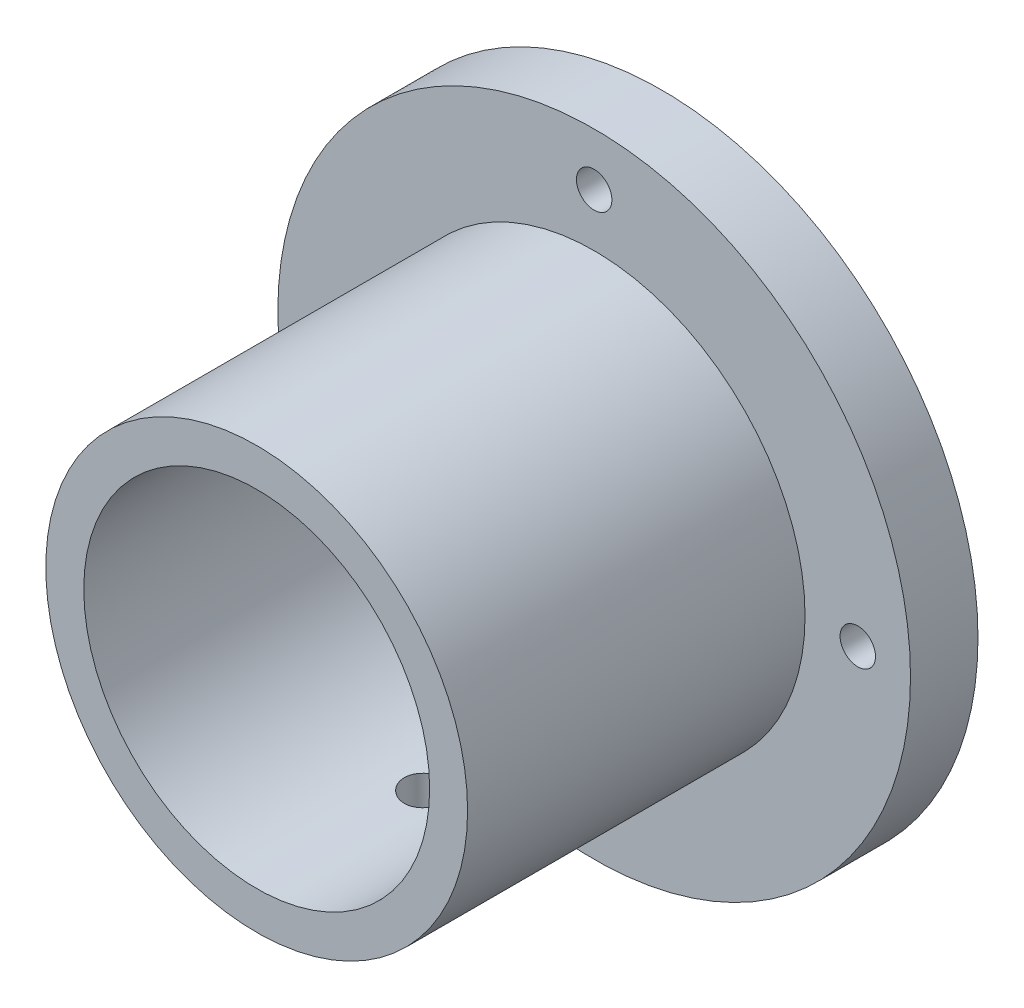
ISO-10303-21;
HEADER;
FILE_DESCRIPTION(('STEP AP214'),'2;1');
FILE_NAME('part.step','',(''),(''),'','','');
FILE_SCHEMA(('AUTOMOTIVE_DESIGN { 1 0 10303 214 1 1 1 1 }'));
ENDSEC;
DATA;
#1=APPLICATION_CONTEXT('core data for automotive mechanical design processes');
#2=APPLICATION_PROTOCOL_DEFINITION('international standard','automotive_design',2000,#1);
#3=PRODUCT_CONTEXT('',#1,'mechanical');
#4=PRODUCT('Part','Part','',(#3));
#5=PRODUCT_RELATED_PRODUCT_CATEGORY('part','',(#4));
#6=PRODUCT_DEFINITION_FORMATION('','',#4);
#7=PRODUCT_DEFINITION_CONTEXT('part definition',#1,'design');
#8=PRODUCT_DEFINITION('design','',#6,#7);
#9=PRODUCT_DEFINITION_SHAPE('','',#8);
#10=(LENGTH_UNIT() NAMED_UNIT(*) SI_UNIT(.MILLI.,.METRE.));
#11=(NAMED_UNIT(*) PLANE_ANGLE_UNIT() SI_UNIT($,.RADIAN.));
#12=(NAMED_UNIT(*) SI_UNIT($,.STERADIAN.) SOLID_ANGLE_UNIT());
#13=UNCERTAINTY_MEASURE_WITH_UNIT(LENGTH_MEASURE(1.E-05),#10,'distance_accuracy_value','');
#14=(GEOMETRIC_REPRESENTATION_CONTEXT(3) GLOBAL_UNCERTAINTY_ASSIGNED_CONTEXT((#13)) GLOBAL_UNIT_ASSIGNED_CONTEXT((#10,
#11,#12)) REPRESENTATION_CONTEXT('',''));
#15=CARTESIAN_POINT('',(0.,0.,0.));
#16=DIRECTION('',(0.,0.,1.));
#17=DIRECTION('',(1.,0.,0.));
#18=AXIS2_PLACEMENT_3D('',#15,#16,#17);
#19=CARTESIAN_POINT('',(-3.63797880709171E-12,3.63797880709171E-12,8.));
#20=DIRECTION('',(0.,0.,1.));
#21=DIRECTION('',(1.,0.,0.));
#22=AXIS2_PLACEMENT_3D('',#19,#20,#21);
#23=PLANE('',#22);
#24=CARTESIAN_POINT('',(31.2499999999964,3.63797880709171E-12,8.));
#25=DIRECTION('',(0.,0.,1.));
#26=DIRECTION('',(1.,0.,0.));
#27=AXIS2_PLACEMENT_3D('',#24,#25,#26);
#28=CIRCLE('',#27,2.1);
#29=CARTESIAN_POINT('',(33.3499999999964,3.63797880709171E-12,8.));
#30=VERTEX_POINT('',#29);
#31=EDGE_CURVE('E64',#30,#30,#28,.T.);
#32=ORIENTED_EDGE('',*,*,#31,.F.);
#33=EDGE_LOOP('',(#32));
#34=FACE_BOUND('',#33,.T.);
#35=CARTESIAN_POINT('',(-31.2500000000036,3.63797880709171E-12,8.));
#36=DIRECTION('',(0.,0.,1.));
#37=DIRECTION('',(1.,0.,0.));
#38=AXIS2_PLACEMENT_3D('',#35,#36,#37);
#39=CIRCLE('',#38,2.1);
#40=CARTESIAN_POINT('',(-29.1500000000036,3.63797880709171E-12,8.));
#41=VERTEX_POINT('',#40);
#42=EDGE_CURVE('E52',#41,#41,#39,.T.);
#43=ORIENTED_EDGE('',*,*,#42,.F.);
#44=EDGE_LOOP('',(#43));
#45=FACE_BOUND('',#44,.T.);
#46=CARTESIAN_POINT('',(-3.63797880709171E-12,3.63797880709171E-12,8.));
#47=DIRECTION('',(0.,0.,1.));
#48=DIRECTION('',(1.,0.,0.));
#49=AXIS2_PLACEMENT_3D('',#46,#47,#48);
#50=CIRCLE('',#49,37.5);
#51=CARTESIAN_POINT('',(37.4999999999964,3.63797880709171E-12,8.));
#52=VERTEX_POINT('',#51);
#53=EDGE_CURVE('E10',#52,#52,#50,.T.);
#54=ORIENTED_EDGE('',*,*,#53,.T.);
#55=EDGE_LOOP('',(#54));
#56=FACE_BOUND('',#55,.T.);
#57=CARTESIAN_POINT('',(-3.63797880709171E-12,31.2500000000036,8.));
#58=DIRECTION('',(0.,0.,1.));
#59=DIRECTION('',(1.,0.,0.));
#60=AXIS2_PLACEMENT_3D('',#57,#58,#59);
#61=CIRCLE('',#60,2.1);
#62=CARTESIAN_POINT('',(2.09999999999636,31.2500000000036,8.));
#63=VERTEX_POINT('',#62);
#64=EDGE_CURVE('E47',#63,#63,#61,.T.);
#65=ORIENTED_EDGE('',*,*,#64,.F.);
#66=EDGE_LOOP('',(#65));
#67=FACE_BOUND('',#66,.T.);
#68=CARTESIAN_POINT('',(-3.63797880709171E-12,-31.2499999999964,8.));
#69=DIRECTION('',(0.,0.,1.));
#70=DIRECTION('',(1.,0.,0.));
#71=AXIS2_PLACEMENT_3D('',#68,#69,#70);
#72=CIRCLE('',#71,2.1);
#73=CARTESIAN_POINT('',(2.09999999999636,-31.2499999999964,8.));
#74=VERTEX_POINT('',#73);
#75=EDGE_CURVE('E58',#74,#74,#72,.T.);
#76=ORIENTED_EDGE('',*,*,#75,.F.);
#77=EDGE_LOOP('',(#76));
#78=FACE_BOUND('',#77,.T.);
#79=CARTESIAN_POINT('',(0.,0.,8.));
#80=DIRECTION('',(0.,0.,1.));
#81=DIRECTION('',(1.,0.,0.));
#82=AXIS2_PLACEMENT_3D('',#79,#80,#81);
#83=CIRCLE('',#82,25.);
#84=CARTESIAN_POINT('',(25.,0.,8.));
#85=VERTEX_POINT('',#84);
#86=EDGE_CURVE('E73',#85,#85,#83,.T.);
#87=ORIENTED_EDGE('',*,*,#86,.F.);
#88=EDGE_LOOP('',(#87));
#89=FACE_BOUND('',#88,.T.);
#90=ADVANCED_FACE('F30',(#34,#45,#56,#67,#78,#89),#23,.T.);
#91=CARTESIAN_POINT('',(-3.63797880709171E-12,3.63797880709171E-12,0.));
#92=DIRECTION('',(0.,0.,1.));
#93=DIRECTION('',(1.,0.,0.));
#94=AXIS2_PLACEMENT_3D('',#91,#92,#93);
#95=PLANE('',#94);
#96=CARTESIAN_POINT('',(0.,0.,0.));
#97=DIRECTION('',(0.,0.,1.));
#98=DIRECTION('',(1.,0.,0.));
#99=AXIS2_PLACEMENT_3D('',#96,#97,#98);
#100=CIRCLE('',#99,20.5);
#101=CARTESIAN_POINT('',(20.5,0.,0.));
#102=VERTEX_POINT('',#101);
#103=EDGE_CURVE('E76',#102,#102,#100,.T.);
#104=ORIENTED_EDGE('',*,*,#103,.T.);
#105=EDGE_LOOP('',(#104));
#106=FACE_BOUND('',#105,.T.);
#107=CARTESIAN_POINT('',(-3.63797880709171E-12,-31.2499999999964,0.));
#108=DIRECTION('',(0.,0.,1.));
#109=DIRECTION('',(1.,0.,0.));
#110=AXIS2_PLACEMENT_3D('',#107,#108,#109);
#111=CIRCLE('',#110,2.1);
#112=CARTESIAN_POINT('',(2.09999999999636,-31.2499999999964,0.));
#113=VERTEX_POINT('',#112);
#114=EDGE_CURVE('E61',#113,#113,#111,.T.);
#115=ORIENTED_EDGE('',*,*,#114,.T.);
#116=EDGE_LOOP('',(#115));
#117=FACE_BOUND('',#116,.T.);
#118=CARTESIAN_POINT('',(-3.63797880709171E-12,31.2500000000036,0.));
#119=DIRECTION('',(0.,0.,1.));
#120=DIRECTION('',(1.,0.,0.));
#121=AXIS2_PLACEMENT_3D('',#118,#119,#120);
#122=CIRCLE('',#121,2.1);
#123=CARTESIAN_POINT('',(2.09999999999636,31.2500000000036,0.));
#124=VERTEX_POINT('',#123);
#125=EDGE_CURVE('E49',#124,#124,#122,.T.);
#126=ORIENTED_EDGE('',*,*,#125,.T.);
#127=EDGE_LOOP('',(#126));
#128=FACE_BOUND('',#127,.T.);
#129=CARTESIAN_POINT('',(-3.63797880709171E-12,3.63797880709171E-12,0.));
#130=DIRECTION('',(0.,0.,1.));
#131=DIRECTION('',(1.,0.,0.));
#132=AXIS2_PLACEMENT_3D('',#129,#130,#131);
#133=CIRCLE('',#132,37.5);
#134=CARTESIAN_POINT('',(37.4999999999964,3.63797880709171E-12,0.));
#135=VERTEX_POINT('',#134);
#136=EDGE_CURVE('E42',#135,#135,#133,.T.);
#137=ORIENTED_EDGE('',*,*,#136,.F.);
#138=EDGE_LOOP('',(#137));
#139=FACE_BOUND('',#138,.T.);
#140=CARTESIAN_POINT('',(-31.2500000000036,3.63797880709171E-12,0.));
#141=DIRECTION('',(0.,0.,1.));
#142=DIRECTION('',(1.,0.,0.));
#143=AXIS2_PLACEMENT_3D('',#140,#141,#142);
#144=CIRCLE('',#143,2.1);
#145=CARTESIAN_POINT('',(-29.1500000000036,3.63797880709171E-12,0.));
#146=VERTEX_POINT('',#145);
#147=EDGE_CURVE('E55',#146,#146,#144,.T.);
#148=ORIENTED_EDGE('',*,*,#147,.T.);
#149=EDGE_LOOP('',(#148));
#150=FACE_BOUND('',#149,.T.);
#151=CARTESIAN_POINT('',(31.2499999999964,3.63797880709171E-12,0.));
#152=DIRECTION('',(0.,0.,1.));
#153=DIRECTION('',(1.,0.,0.));
#154=AXIS2_PLACEMENT_3D('',#151,#152,#153);
#155=CIRCLE('',#154,2.1);
#156=CARTESIAN_POINT('',(33.3499999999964,3.63797880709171E-12,0.));
#157=VERTEX_POINT('',#156);
#158=EDGE_CURVE('E67',#157,#157,#155,.T.);
#159=ORIENTED_EDGE('',*,*,#158,.T.);
#160=EDGE_LOOP('',(#159));
#161=FACE_BOUND('',#160,.T.);
#162=ADVANCED_FACE('F113',(#106,#117,#128,#139,#150,#161),#95,.F.);
#163=CARTESIAN_POINT('',(-3.63797880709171E-12,3.63797880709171E-12,8.));
#164=DIRECTION('',(0.,0.,-1.));
#165=DIRECTION('',(-1.,0.,0.));
#166=AXIS2_PLACEMENT_3D('',#163,#164,#165);
#167=CYLINDRICAL_SURFACE('',#166,37.5);
#168=ORIENTED_EDGE('',*,*,#53,.F.);
#169=EDGE_LOOP('',(#168));
#170=FACE_BOUND('',#169,.T.);
#171=ORIENTED_EDGE('',*,*,#136,.T.);
#172=EDGE_LOOP('',(#171));
#173=FACE_BOUND('',#172,.T.);
#174=ADVANCED_FACE('F32',(#170,#173),#167,.T.);
#175=CARTESIAN_POINT('',(-3.63797880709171E-12,31.2500000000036,8.));
#176=DIRECTION('',(0.,0.,-1.));
#177=DIRECTION('',(-1.,0.,0.));
#178=AXIS2_PLACEMENT_3D('',#175,#176,#177);
#179=CYLINDRICAL_SURFACE('',#178,2.1);
#180=ORIENTED_EDGE('',*,*,#64,.T.);
#181=EDGE_LOOP('',(#180));
#182=FACE_BOUND('',#181,.T.);
#183=ORIENTED_EDGE('',*,*,#125,.F.);
#184=EDGE_LOOP('',(#183));
#185=FACE_BOUND('',#184,.T.);
#186=ADVANCED_FACE('F123',(#182,#185),#179,.F.);
#187=CARTESIAN_POINT('',(-31.2500000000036,3.63797880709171E-12,8.));
#188=DIRECTION('',(0.,0.,-1.));
#189=DIRECTION('',(-1.,0.,0.));
#190=AXIS2_PLACEMENT_3D('',#187,#188,#189);
#191=CYLINDRICAL_SURFACE('',#190,2.1);
#192=ORIENTED_EDGE('',*,*,#42,.T.);
#193=EDGE_LOOP('',(#192));
#194=FACE_BOUND('',#193,.T.);
#195=ORIENTED_EDGE('',*,*,#147,.F.);
#196=EDGE_LOOP('',(#195));
#197=FACE_BOUND('',#196,.T.);
#198=ADVANCED_FACE('F126',(#194,#197),#191,.F.);
#199=CARTESIAN_POINT('',(-3.63797880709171E-12,-31.2499999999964,8.));
#200=DIRECTION('',(0.,0.,-1.));
#201=DIRECTION('',(-1.,0.,0.));
#202=AXIS2_PLACEMENT_3D('',#199,#200,#201);
#203=CYLINDRICAL_SURFACE('',#202,2.1);
#204=ORIENTED_EDGE('',*,*,#75,.T.);
#205=EDGE_LOOP('',(#204));
#206=FACE_BOUND('',#205,.T.);
#207=ORIENTED_EDGE('',*,*,#114,.F.);
#208=EDGE_LOOP('',(#207));
#209=FACE_BOUND('',#208,.T.);
#210=ADVANCED_FACE('F130',(#206,#209),#203,.F.);
#211=CARTESIAN_POINT('',(31.2499999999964,3.63797880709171E-12,8.));
#212=DIRECTION('',(0.,0.,-1.));
#213=DIRECTION('',(-1.,0.,0.));
#214=AXIS2_PLACEMENT_3D('',#211,#212,#213);
#215=CYLINDRICAL_SURFACE('',#214,2.1);
#216=ORIENTED_EDGE('',*,*,#31,.T.);
#217=EDGE_LOOP('',(#216));
#218=FACE_BOUND('',#217,.T.);
#219=ORIENTED_EDGE('',*,*,#158,.F.);
#220=EDGE_LOOP('',(#219));
#221=FACE_BOUND('',#220,.T.);
#222=ADVANCED_FACE('F108',(#218,#221),#215,.F.);
#223=CARTESIAN_POINT('',(0.,0.,48.));
#224=DIRECTION('',(0.,0.,-1.));
#225=DIRECTION('',(-1.,0.,0.));
#226=AXIS2_PLACEMENT_3D('',#223,#224,#225);
#227=CYLINDRICAL_SURFACE('',#226,25.);
#228=CARTESIAN_POINT('',(0.,-25.,30.5));
#229=CARTESIAN_POINT('',(0.140050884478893,-24.9999983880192,30.4999939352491));
#230=CARTESIAN_POINT('',(0.280194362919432,-24.9988106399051,30.4881918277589));
#231=CARTESIAN_POINT('',(0.556595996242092,-24.9941866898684,30.4412890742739));
#232=CARTESIAN_POINT('',(0.69284969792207,-24.9907480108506,30.4061627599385));
#233=CARTESIAN_POINT('',(0.957429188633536,-24.9820103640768,30.3136443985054));
#234=CARTESIAN_POINT('',(1.08575971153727,-24.9767125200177,30.2562657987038));
#235=CARTESIAN_POINT('',(1.33094040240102,-24.9648489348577,30.1208977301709));
#236=CARTESIAN_POINT('',(1.44779284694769,-24.9582834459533,30.0429123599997));
#237=CARTESIAN_POINT('',(1.6671488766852,-24.9445936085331,29.8682432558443));
#238=CARTESIAN_POINT('',(1.76960536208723,-24.9374675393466,29.7715005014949));
#239=CARTESIAN_POINT('',(1.95685630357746,-24.9234739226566,29.5621886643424));
#240=CARTESIAN_POINT('',(2.04164994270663,-24.9166063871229,29.449618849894));
#241=CARTESIAN_POINT('',(2.19133492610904,-24.9038897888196,29.2115536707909));
#242=CARTESIAN_POINT('',(2.2561836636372,-24.8980429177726,29.0860313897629));
#243=CARTESIAN_POINT('',(2.3638659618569,-24.8880509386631,28.8258110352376));
#244=CARTESIAN_POINT('',(2.40670006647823,-24.8839057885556,28.6911131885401));
#245=CARTESIAN_POINT('',(2.46899760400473,-24.8778021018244,28.416845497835));
#246=CARTESIAN_POINT('',(2.48853913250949,-24.8758362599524,28.2772935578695));
#247=CARTESIAN_POINT('',(2.5039382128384,-24.8742910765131,27.9968778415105));
#248=CARTESIAN_POINT('',(2.499796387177,-24.8747116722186,27.8560140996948));
#249=CARTESIAN_POINT('',(2.4680107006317,-24.8778851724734,27.5775117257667));
#250=CARTESIAN_POINT('',(2.44045211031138,-24.8806296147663,27.4398632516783));
#251=CARTESIAN_POINT('',(2.36274786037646,-24.8881283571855,27.1711550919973));
#252=CARTESIAN_POINT('',(2.31260189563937,-24.8928826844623,27.0400954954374));
#253=CARTESIAN_POINT('',(2.19105223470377,-24.9038752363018,26.7880160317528));
#254=CARTESIAN_POINT('',(2.11961070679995,-24.9101160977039,26.6670145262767));
#255=CARTESIAN_POINT('',(1.95752506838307,-24.923376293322,26.4386869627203));
#256=CARTESIAN_POINT('',(1.86688039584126,-24.9303956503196,26.3313613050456));
#257=CARTESIAN_POINT('',(1.66848528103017,-24.9444596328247,26.1329365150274));
#258=CARTESIAN_POINT('',(1.56066119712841,-24.9515042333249,26.041910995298));
#259=CARTESIAN_POINT('',(1.33122370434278,-24.964795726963,25.879240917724));
#260=CARTESIAN_POINT('',(1.209610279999,-24.9710426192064,25.8075963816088));
#261=CARTESIAN_POINT('',(0.955995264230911,-24.9820368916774,25.6857249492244));
#262=CARTESIAN_POINT('',(0.823991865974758,-24.9867840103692,25.6355017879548));
#263=CARTESIAN_POINT('',(0.553368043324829,-24.9942411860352,25.5579527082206));
#264=CARTESIAN_POINT('',(0.4147478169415,-24.9969513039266,25.5306261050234));
#265=CARTESIAN_POINT('',(0.135462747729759,-25.0000212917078,25.4997392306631));
#266=CARTESIAN_POINT('',(-0.00519075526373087,-25.0003912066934,25.4960773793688));
#267=CARTESIAN_POINT('',(-0.28510948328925,-24.9987660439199,25.5123571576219));
#268=CARTESIAN_POINT('',(-0.424374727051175,-24.9967709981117,25.5322984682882));
#269=CARTESIAN_POINT('',(-0.697270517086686,-24.9906465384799,25.5951342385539));
#270=CARTESIAN_POINT('',(-0.830912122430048,-24.986521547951,25.637981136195));
#271=CARTESIAN_POINT('',(-1.08911080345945,-24.9765999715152,25.7453629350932));
#272=CARTESIAN_POINT('',(-1.21366767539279,-24.9708033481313,25.8098983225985));
#273=CARTESIAN_POINT('',(-1.45062045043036,-24.9581618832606,25.9590770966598));
#274=CARTESIAN_POINT('',(-1.56297414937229,-24.951313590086,26.0437872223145));
#275=CARTESIAN_POINT('',(-1.7719040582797,-24.937348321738,26.2308151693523));
#276=CARTESIAN_POINT('',(-1.86847987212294,-24.9302313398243,26.3331334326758));
#277=CARTESIAN_POINT('',(-2.04346527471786,-24.9165006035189,26.5529164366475));
#278=CARTESIAN_POINT('',(-2.12180819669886,-24.9098887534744,26.6704343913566));
#279=CARTESIAN_POINT('',(-2.25764564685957,-24.8979458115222,26.9170184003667));
#280=CARTESIAN_POINT('',(-2.3151404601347,-24.8926147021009,27.046084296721));
#281=CARTESIAN_POINT('',(-2.40753802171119,-24.8838486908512,27.3118718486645));
#282=CARTESIAN_POINT('',(-2.44248043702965,-24.8804104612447,27.4485796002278));
#283=CARTESIAN_POINT('',(-2.48891001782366,-24.8758091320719,27.7259579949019));
#284=CARTESIAN_POINT('',(-2.50039785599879,-24.8746459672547,27.8666285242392));
#285=CARTESIAN_POINT('',(-2.49958284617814,-24.8747278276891,28.1472767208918));
#286=CARTESIAN_POINT('',(-2.48738472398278,-24.8759622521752,28.287254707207));
#287=CARTESIAN_POINT('',(-2.43976363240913,-24.8806775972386,28.5631622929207));
#288=CARTESIAN_POINT('',(-2.4043406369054,-24.884158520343,28.699091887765));
#289=CARTESIAN_POINT('',(-2.31130421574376,-24.8929717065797,28.9630433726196));
#290=CARTESIAN_POINT('',(-2.25369386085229,-24.898303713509,29.0910663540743));
#291=CARTESIAN_POINT('',(-2.11792888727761,-24.910218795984,29.3356422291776));
#292=CARTESIAN_POINT('',(-2.03977438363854,-24.9168018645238,29.4521951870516));
#293=CARTESIAN_POINT('',(-1.86474639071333,-24.9305121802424,29.6710591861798));
#294=CARTESIAN_POINT('',(-1.76779487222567,-24.9376416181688,29.7733076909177));
#295=CARTESIAN_POINT('',(-1.55807924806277,-24.9516213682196,29.9601305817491));
#296=CARTESIAN_POINT('',(-1.44531136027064,-24.9584716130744,30.0447007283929));
#297=CARTESIAN_POINT('',(-1.20685358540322,-24.971139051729,30.1939336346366));
#298=CARTESIAN_POINT('',(-1.08113187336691,-24.9769536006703,30.258545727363));
#299=CARTESIAN_POINT('',(-0.820645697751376,-24.9868657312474,30.3656560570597));
#300=CARTESIAN_POINT('',(-0.685891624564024,-24.9909652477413,30.4081792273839));
#301=CARTESIAN_POINT('',(-0.458645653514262,-24.9959553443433,30.459301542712));
#302=CARTESIAN_POINT('',(-0.367606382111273,-24.9974650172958,30.4745426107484));
#303=CARTESIAN_POINT('',(-0.184391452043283,-24.9994878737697,30.4948938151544));
#304=CARTESIAN_POINT('',(-0.0922157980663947,-25.0000010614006,30.5000039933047));
#305=CARTESIAN_POINT('',(0.,-25.,30.5));
#306=B_SPLINE_CURVE_WITH_KNOTS('',3,(#228,#229,#230,#231,#232,#233,#234,#235,#236,#237,#238,
#239,#240,#241,#242,#243,#244,#245,#246,#247,#248,#249,#250,#251,#252,#253,#254,#255,#256,#257,
#258,#259,#260,#261,#262,#263,#264,#265,#266,#267,#268,#269,#270,#271,#272,#273,#274,#275,#276,
#277,#278,#279,#280,#281,#282,#283,#284,#285,#286,#287,#288,#289,#290,#291,#292,#293,#294,#295,
#296,#297,#298,#299,#300,#301,#302,#303,#304,#305),.UNSPECIFIED.,.T.,.F.,(4,2,2,2,2,2,2,2,2,2,2,
2,2,2,2,2,2,2,2,2,2,2,2,2,2,2,2,2,2,2,2,2,2,2,2,2,2,2,4),(0.,0.419815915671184,
0.840094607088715,1.26011971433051,1.68006134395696,2.10134642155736,2.52265098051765,
2.94484938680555,3.3670373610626,3.78780580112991,4.20856318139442,4.62779493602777,
5.04703235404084,5.46701903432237,5.88701800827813,6.30886835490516,6.73071917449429,
7.15264351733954,7.57455524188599,7.99465471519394,8.41474851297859,8.83397338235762,
9.25320765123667,9.67384851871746,10.0944999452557,10.516666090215,10.9388264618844,
11.3602422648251,11.7816459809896,12.2011907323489,12.620735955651,13.04022313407,
13.459707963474,13.8809729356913,14.3023388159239,14.7247657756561,15.1467148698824,
15.4231416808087,15.6995673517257),.UNSPECIFIED.);
#307=CARTESIAN_POINT('',(0.,-25.,30.5));
#308=VERTEX_POINT('',#307);
#309=EDGE_CURVE('E82',#308,#308,#306,.T.);
#310=ORIENTED_EDGE('',*,*,#309,.T.);
#311=EDGE_LOOP('',(#310));
#312=FACE_BOUND('',#311,.T.);
#313=CARTESIAN_POINT('',(0.,0.,48.));
#314=DIRECTION('',(0.,0.,1.));
#315=DIRECTION('',(1.,0.,0.));
#316=AXIS2_PLACEMENT_3D('',#313,#314,#315);
#317=CIRCLE('',#316,25.);
#318=CARTESIAN_POINT('',(25.,0.,48.));
#319=VERTEX_POINT('',#318);
#320=EDGE_CURVE('E70',#319,#319,#317,.T.);
#321=ORIENTED_EDGE('',*,*,#320,.F.);
#322=EDGE_LOOP('',(#321));
#323=FACE_BOUND('',#322,.T.);
#324=ORIENTED_EDGE('',*,*,#86,.T.);
#325=EDGE_LOOP('',(#324));
#326=FACE_BOUND('',#325,.T.);
#327=ADVANCED_FACE('F89',(#312,#323,#326),#227,.T.);
#328=CARTESIAN_POINT('',(0.,0.,48.));
#329=DIRECTION('',(0.,0.,1.));
#330=DIRECTION('',(1.,0.,0.));
#331=AXIS2_PLACEMENT_3D('',#328,#329,#330);
#332=PLANE('',#331);
#333=CARTESIAN_POINT('',(0.,0.,48.));
#334=DIRECTION('',(0.,0.,1.));
#335=DIRECTION('',(1.,0.,0.));
#336=AXIS2_PLACEMENT_3D('',#333,#334,#335);
#337=CIRCLE('',#336,20.5);
#338=CARTESIAN_POINT('',(20.5,0.,48.));
#339=VERTEX_POINT('',#338);
#340=EDGE_CURVE('E79',#339,#339,#337,.T.);
#341=ORIENTED_EDGE('',*,*,#340,.F.);
#342=EDGE_LOOP('',(#341));
#343=FACE_BOUND('',#342,.T.);
#344=ORIENTED_EDGE('',*,*,#320,.T.);
#345=EDGE_LOOP('',(#344));
#346=FACE_BOUND('',#345,.T.);
#347=ADVANCED_FACE('F101',(#343,#346),#332,.T.);
#348=CARTESIAN_POINT('',(0.,0.,0.));
#349=DIRECTION('',(0.,0.,1.));
#350=DIRECTION('',(1.,0.,0.));
#351=AXIS2_PLACEMENT_3D('',#348,#349,#350);
#352=CYLINDRICAL_SURFACE('',#351,20.5);
#353=CARTESIAN_POINT('',(0.,-20.5,30.5));
#354=CARTESIAN_POINT('',(-0.139869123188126,-20.4999980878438,30.4999940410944));
#355=CARTESIAN_POINT('',(-0.279826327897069,-20.4985534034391,30.4882224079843));
#356=CARTESIAN_POINT('',(-0.55584812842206,-20.4929292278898,30.4414477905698));
#357=CARTESIAN_POINT('',(-0.691908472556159,-20.4887468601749,30.4064203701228));
#358=CARTESIAN_POINT('',(-0.956100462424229,-20.4781186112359,30.3141798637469));
#359=CARTESIAN_POINT('',(-1.08423730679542,-20.4716742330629,30.2569815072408));
#360=CARTESIAN_POINT('',(-1.32906818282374,-20.4572392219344,30.1220545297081));
#361=CARTESIAN_POINT('',(-1.44576421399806,-20.4492488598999,30.0443295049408));
#362=CARTESIAN_POINT('',(-1.66503849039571,-20.4325674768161,29.8701189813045));
#363=CARTESIAN_POINT('',(-1.76754802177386,-20.4238733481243,29.7735472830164));
#364=CARTESIAN_POINT('',(-1.95494779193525,-20.4067894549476,29.5645696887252));
#365=CARTESIAN_POINT('',(-2.03983714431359,-20.3983997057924,29.4521629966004));
#366=CARTESIAN_POINT('',(-2.18984130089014,-20.3828437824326,29.2142616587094));
#367=CARTESIAN_POINT('',(-2.25489199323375,-20.3756816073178,29.0887263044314));
#368=CARTESIAN_POINT('',(-2.36296285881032,-20.3634324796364,28.8284112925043));
#369=CARTESIAN_POINT('',(-2.40598382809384,-20.3583454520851,28.6936319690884));
#370=CARTESIAN_POINT('',(-2.46856584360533,-20.3508521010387,28.419366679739));
#371=CARTESIAN_POINT('',(-2.48824268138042,-20.3484325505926,28.2799075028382));
#372=CARTESIAN_POINT('',(-2.50393613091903,-20.3465075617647,27.9996469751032));
#373=CARTESIAN_POINT('',(-2.49995364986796,-20.3470020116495,27.8588456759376));
#374=CARTESIAN_POINT('',(-2.46853661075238,-20.3508370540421,27.58070352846));
#375=CARTESIAN_POINT('',(-2.44122945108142,-20.3541621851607,27.4433480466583));
#376=CARTESIAN_POINT('',(-2.36413690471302,-20.3632598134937,27.1751838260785));
#377=CARTESIAN_POINT('',(-2.31435108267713,-20.3690323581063,27.0443752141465));
#378=CARTESIAN_POINT('',(-2.19357702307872,-20.3823919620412,26.7926212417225));
#379=CARTESIAN_POINT('',(-2.12253326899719,-20.3899837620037,26.6717027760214));
#380=CARTESIAN_POINT('',(-1.96129975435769,-20.4061227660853,26.443456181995));
#381=CARTESIAN_POINT('',(-1.87110916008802,-20.4146700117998,26.3361286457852));
#382=CARTESIAN_POINT('',(-1.67343536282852,-20.4318256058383,26.1373709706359));
#383=CARTESIAN_POINT('',(-1.56584232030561,-20.4404339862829,26.0460500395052));
#384=CARTESIAN_POINT('',(-1.33679641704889,-20.4566892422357,25.8827476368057));
#385=CARTESIAN_POINT('',(-1.21534352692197,-20.4643361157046,25.8107662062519));
#386=CARTESIAN_POINT('',(-0.961942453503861,-20.4778111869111,25.6881866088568));
#387=CARTESIAN_POINT('',(-0.829991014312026,-20.4836388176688,25.6375951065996));
#388=CARTESIAN_POINT('',(-0.559379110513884,-20.4928135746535,25.5593172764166));
#389=CARTESIAN_POINT('',(-0.420718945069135,-20.49616081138,25.5316299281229));
#390=CARTESIAN_POINT('',(-0.141570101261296,-20.499983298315,25.5000874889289));
#391=CARTESIAN_POINT('',(-0.00109866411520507,-20.5004766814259,25.4960819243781));
#392=CARTESIAN_POINT('',(0.278513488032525,-20.4985847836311,25.5116199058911));
#393=CARTESIAN_POINT('',(0.417654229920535,-20.4961995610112,25.531162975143));
#394=CARTESIAN_POINT('',(0.690212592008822,-20.4888297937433,25.5931184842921));
#395=CARTESIAN_POINT('',(0.823646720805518,-20.4838533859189,25.6354593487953));
#396=CARTESIAN_POINT('',(1.08152018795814,-20.4718585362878,25.7417342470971));
#397=CARTESIAN_POINT('',(1.20595923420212,-20.4648400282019,25.8056689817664));
#398=CARTESIAN_POINT('',(1.44298330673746,-20.4494985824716,25.9536820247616));
#399=CARTESIAN_POINT('',(1.55550701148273,-20.4411693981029,26.037857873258));
#400=CARTESIAN_POINT('',(1.76488280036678,-20.4241583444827,26.2238254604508));
#401=CARTESIAN_POINT('',(1.86173429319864,-20.4154764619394,26.3256178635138));
#402=CARTESIAN_POINT('',(2.03754876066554,-20.3986827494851,26.5445910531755));
#403=CARTESIAN_POINT('',(2.11641211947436,-20.3905742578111,26.6618521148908));
#404=CARTESIAN_POINT('',(2.25332394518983,-20.3758997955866,26.9080436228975));
#405=CARTESIAN_POINT('',(2.31137281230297,-20.3693337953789,27.0369738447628));
#406=CARTESIAN_POINT('',(2.40484584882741,-20.3585102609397,27.3025197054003));
#407=CARTESIAN_POINT('',(2.44032659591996,-20.3542469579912,27.4391151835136));
#408=CARTESIAN_POINT('',(2.48783861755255,-20.3484948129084,27.7163804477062));
#409=CARTESIAN_POINT('',(2.49987092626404,-20.3470058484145,27.857050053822));
#410=CARTESIAN_POINT('',(2.50012616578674,-20.3469744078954,28.1374795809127));
#411=CARTESIAN_POINT('',(2.48850559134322,-20.3484125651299,28.2772393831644));
#412=CARTESIAN_POINT('',(2.44211588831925,-20.3540317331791,28.5528038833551));
#413=CARTESIAN_POINT('',(2.40734675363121,-20.3582127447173,28.6886085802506));
#414=CARTESIAN_POINT('',(2.31569508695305,-20.3688406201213,28.9523898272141));
#415=CARTESIAN_POINT('',(2.25881970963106,-20.3752867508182,29.0803688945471));
#416=CARTESIAN_POINT('',(2.1245854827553,-20.3897197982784,29.3249915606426));
#417=CARTESIAN_POINT('',(2.04722642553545,-20.3977067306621,29.4416350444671));
#418=CARTESIAN_POINT('',(1.87363904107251,-20.4143847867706,29.6610758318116));
#419=CARTESIAN_POINT('',(1.77729404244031,-20.4230800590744,29.7637805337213));
#420=CARTESIAN_POINT('',(1.56871201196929,-20.4401582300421,29.9516257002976));
#421=CARTESIAN_POINT('',(1.45647123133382,-20.4485410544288,30.0367620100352));
#422=CARTESIAN_POINT('',(1.21881917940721,-20.464083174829,30.1873144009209));
#423=CARTESIAN_POINT('',(1.09336163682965,-20.4712379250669,30.2526578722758));
#424=CARTESIAN_POINT('',(0.833238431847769,-20.483471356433,30.3612571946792));
#425=CARTESIAN_POINT('',(0.698583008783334,-20.4885523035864,30.404537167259));
#426=CARTESIAN_POINT('',(0.469351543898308,-20.4948338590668,30.4573630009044));
#427=CARTESIAN_POINT('',(0.376223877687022,-20.4967617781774,30.4733290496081));
#428=CARTESIAN_POINT('',(0.188744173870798,-20.4993454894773,30.4946495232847));
#429=CARTESIAN_POINT('',(0.0943921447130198,-20.5000012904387,30.5000040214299));
#430=CARTESIAN_POINT('',(0.,-20.5,30.5));
#431=B_SPLINE_CURVE_WITH_KNOTS('',3,(#353,#354,#355,#356,#357,#358,#359,#360,#361,#362,#363,
#364,#365,#366,#367,#368,#369,#370,#371,#372,#373,#374,#375,#376,#377,#378,#379,#380,#381,#382,
#383,#384,#385,#386,#387,#388,#389,#390,#391,#392,#393,#394,#395,#396,#397,#398,#399,#400,#401,
#402,#403,#404,#405,#406,#407,#408,#409,#410,#411,#412,#413,#414,#415,#416,#417,#418,#419,#420,
#421,#422,#423,#424,#425,#426,#427,#428,#429,#430),.UNSPECIFIED.,.T.,.F.,(4,2,2,2,2,2,2,2,2,2,2,
2,2,2,2,2,2,2,2,2,2,2,2,2,2,2,2,2,2,2,2,2,2,2,2,2,2,2,4),(0.,0.419262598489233,
0.838966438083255,1.25839192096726,1.67774396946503,2.09906097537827,2.52039917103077,
2.94308490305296,3.36575536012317,3.78632040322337,4.2068693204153,4.62513579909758,
5.043410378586,5.46278698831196,5.88218186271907,6.30433529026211,6.72648961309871,
7.14877537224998,7.57104231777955,7.99062327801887,8.41019574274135,8.82845854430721,
9.24673492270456,9.66706882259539,10.0874185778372,10.5100425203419,10.9326583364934,
11.3542104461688,11.7757439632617,12.1944975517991,12.6132512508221,13.0318695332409,
13.4504920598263,13.8717721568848,14.2931517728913,14.7160589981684,15.1385028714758,
15.4214485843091,15.7043923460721),.UNSPECIFIED.);
#432=CARTESIAN_POINT('',(0.,-20.5,30.5));
#433=VERTEX_POINT('',#432);
#434=EDGE_CURVE('E34',#433,#433,#431,.T.);
#435=ORIENTED_EDGE('',*,*,#434,.T.);
#436=EDGE_LOOP('',(#435));
#437=FACE_BOUND('',#436,.T.);
#438=ORIENTED_EDGE('',*,*,#103,.F.);
#439=EDGE_LOOP('',(#438));
#440=FACE_BOUND('',#439,.T.);
#441=ORIENTED_EDGE('',*,*,#340,.T.);
#442=EDGE_LOOP('',(#441));
#443=FACE_BOUND('',#442,.T.);
#444=ADVANCED_FACE('F96',(#437,#440,#443),#352,.F.);
#445=CARTESIAN_POINT('',(0.,-30.,28.));
#446=DIRECTION('',(0.,1.,0.));
#447=DIRECTION('',(0.,0.,1.));
#448=AXIS2_PLACEMENT_3D('',#445,#446,#447);
#449=CYLINDRICAL_SURFACE('',#448,2.5);
#450=ORIENTED_EDGE('',*,*,#434,.F.);
#451=EDGE_LOOP('',(#450));
#452=FACE_BOUND('',#451,.T.);
#453=ORIENTED_EDGE('',*,*,#309,.F.);
#454=EDGE_LOOP('',(#453));
#455=FACE_BOUND('',#454,.T.);
#456=ADVANCED_FACE('F93',(#452,#455),#449,.F.);
#457=CLOSED_SHELL('',(#90,#162,#174,#186,#198,#210,#222,#327,#347,#444,#456));
#458=MANIFOLD_SOLID_BREP('B2',#457);
#459=ADVANCED_BREP_SHAPE_REPRESENTATION('',(#18,#458),#14);
#460=SHAPE_DEFINITION_REPRESENTATION(#9,#459);
ENDSEC;
END-ISO-10303-21;
